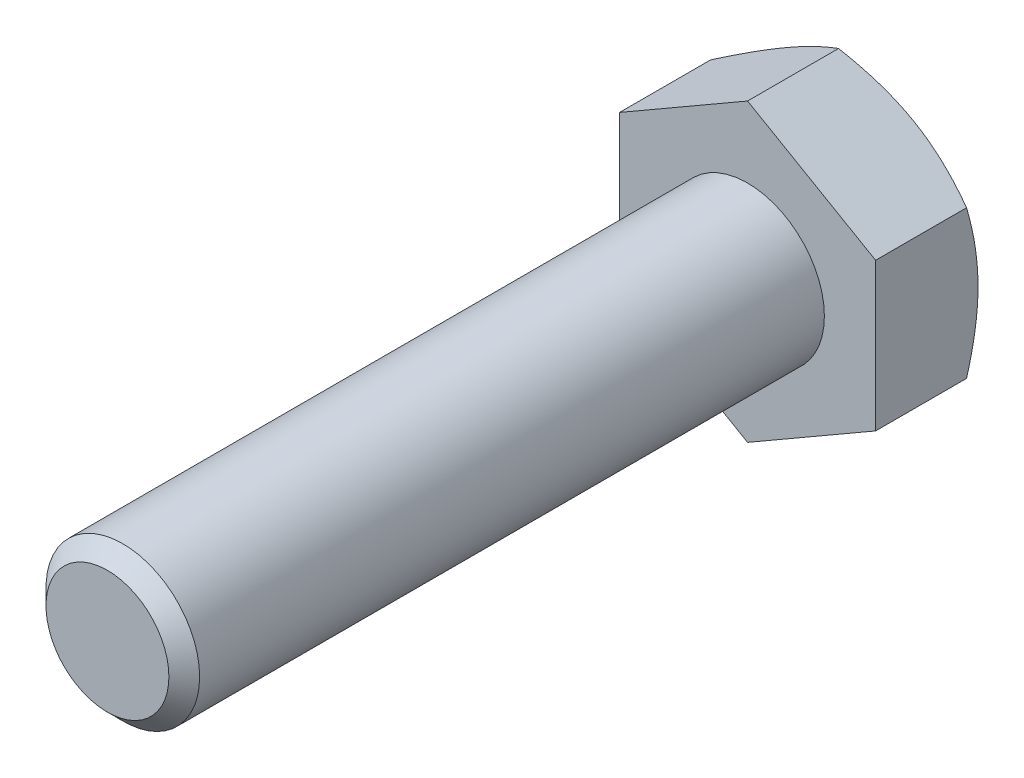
from build123d import *

# Parameters (mm, degrees)
ESQUISSE1_W        = 3
ESQUISSE1_H        = 25
CHANFREIN1_SIZE    = 0.6
BOSS_EXTRU_1_DEPTH = 4


with BuildPart() as part:
    # Esquisse1 → Base-R_volution (revolve)
    with BuildSketch(Plane(origin=(0, 0, 0), x_dir=(1, 0, 0), z_dir=(0, 1, 0))):
        with Locations((1.5, -12.5)):
            Rectangle(ESQUISSE1_W, ESQUISSE1_H)
    revolve(axis=Axis((0, 0, 0), (0, 0, 1)))

    # Chanfrein1
    chanfrein1_edges = [part.edges().sort_by_distance(p)[0] for p in [
        (-3, 0, 25),
    ]]
    chamfer(chanfrein1_edges, length=CHANFREIN1_SIZE)

    # Esquisse6 → Boss.-Extru.1 (add)
    with BuildSketch(Plane.XY):
        Polygon((5, -2.886751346), (5, 2.886751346), (0, 5.773502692), (-5, 2.886751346), (-5, -2.886751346), (0, -5.773502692), align=None)
    extrude(amount=-BOSS_EXTRU_1_DEPTH)

    # Esquisse7 → Enl_vement de mati_re-R_volution1 (revolve, cut)
    with BuildSketch(Plane(origin=(0, 0, 0), x_dir=(1, 0, 0), z_dir=(0, 1, 0))):
        Polygon((-5, 4), (-11.92820323, 4), (-11.92820323, 0), align=None)
    revolve(axis=Axis((0, 0, -6.239446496), (0, 0, 1)), mode=Mode.SUBTRACT)


solid = part.part
